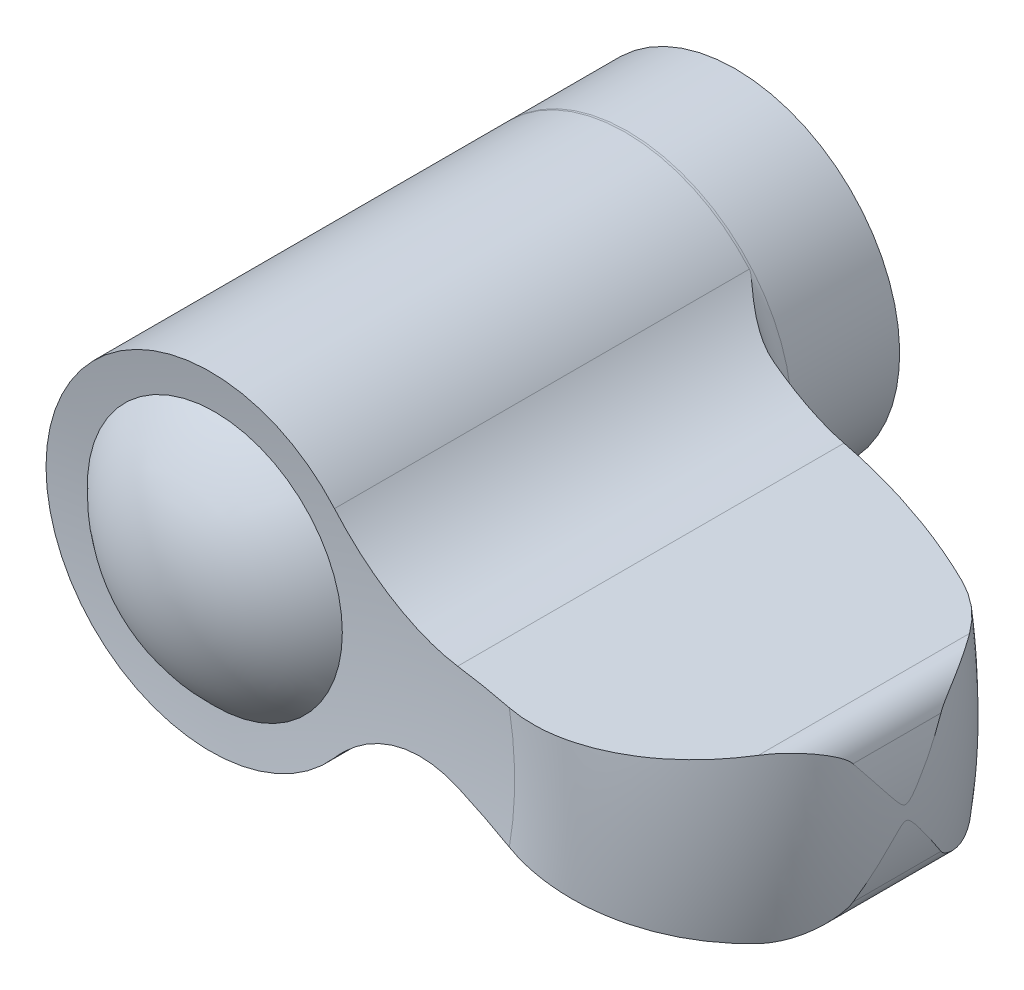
ISO-10303-21;
HEADER;
FILE_DESCRIPTION(('STEP AP214'),'2;1');
FILE_NAME('part.step','',(''),(''),'','','');
FILE_SCHEMA(('AUTOMOTIVE_DESIGN { 1 0 10303 214 1 1 1 1 }'));
ENDSEC;
DATA;
#1=APPLICATION_CONTEXT('core data for automotive mechanical design processes');
#2=APPLICATION_PROTOCOL_DEFINITION('international standard','automotive_design',2000,#1);
#3=PRODUCT_CONTEXT('',#1,'mechanical');
#4=PRODUCT('Part','Part','',(#3));
#5=PRODUCT_RELATED_PRODUCT_CATEGORY('part','',(#4));
#6=PRODUCT_DEFINITION_FORMATION('','',#4);
#7=PRODUCT_DEFINITION_CONTEXT('part definition',#1,'design');
#8=PRODUCT_DEFINITION('design','',#6,#7);
#9=PRODUCT_DEFINITION_SHAPE('','',#8);
#10=(LENGTH_UNIT() NAMED_UNIT(*) SI_UNIT(.MILLI.,.METRE.));
#11=(NAMED_UNIT(*) PLANE_ANGLE_UNIT() SI_UNIT($,.RADIAN.));
#12=(NAMED_UNIT(*) SI_UNIT($,.STERADIAN.) SOLID_ANGLE_UNIT());
#13=UNCERTAINTY_MEASURE_WITH_UNIT(LENGTH_MEASURE(1.E-05),#10,'distance_accuracy_value','');
#14=(GEOMETRIC_REPRESENTATION_CONTEXT(3) GLOBAL_UNCERTAINTY_ASSIGNED_CONTEXT((#13)) GLOBAL_UNIT_ASSIGNED_CONTEXT((#10,
#11,#12)) REPRESENTATION_CONTEXT('',''));
#15=CARTESIAN_POINT('',(0.,0.,0.));
#16=DIRECTION('',(0.,0.,1.));
#17=DIRECTION('',(1.,0.,0.));
#18=AXIS2_PLACEMENT_3D('',#15,#16,#17);
#19=CARTESIAN_POINT('',(0.,0.,53.8162032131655));
#20=DIRECTION('',(0.,0.,-1.));
#21=DIRECTION('',(0.,1.,0.));
#22=AXIS2_PLACEMENT_3D('',#19,#20,#21);
#23=DEGENERATE_TOROIDAL_SURFACE('',#22,0.00379687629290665,47.9877389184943,.F.);
#24=CARTESIAN_POINT('',(5.72647350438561,-5.62912183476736,6.5057119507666));
#25=CARTESIAN_POINT('',(5.8343902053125,-5.48849659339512,6.50203884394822));
#26=CARTESIAN_POINT('',(5.94702418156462,-5.35144406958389,6.50036273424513));
#27=CARTESIAN_POINT('',(6.18114547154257,-5.08511214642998,6.50099658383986));
#28=CARTESIAN_POINT('',(6.30263348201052,-4.95583336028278,6.50330685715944));
#29=CARTESIAN_POINT('',(6.55355658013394,-4.70600547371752,6.51189558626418));
#30=CARTESIAN_POINT('',(6.68297146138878,-4.58543575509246,6.51816430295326));
#31=CARTESIAN_POINT('',(6.9493261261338,-4.35326969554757,6.53462108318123));
#32=CARTESIAN_POINT('',(7.08626487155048,-4.24167212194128,6.54480860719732));
#33=CARTESIAN_POINT('',(7.44085197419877,-3.97172031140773,6.57542657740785));
#34=CARTESIAN_POINT('',(7.66308997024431,-3.81962161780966,6.59842633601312));
#35=CARTESIAN_POINT('',(8.12105037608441,-3.53891749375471,6.65315252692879));
#36=CARTESIAN_POINT('',(8.35677912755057,-3.41032323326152,6.68488309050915));
#37=CARTESIAN_POINT('',(8.77318529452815,-3.2095150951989,6.74688203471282));
#38=CARTESIAN_POINT('',(8.9513773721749,-3.13148322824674,6.77519644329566));
#39=CARTESIAN_POINT('',(9.31238283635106,-2.98878571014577,6.83605747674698));
#40=CARTESIAN_POINT('',(9.49519711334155,-2.92412265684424,6.86860492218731));
#41=CARTESIAN_POINT('',(9.86442053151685,-2.80838393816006,6.93774319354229));
#42=CARTESIAN_POINT('',(10.0508312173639,-2.7573142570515,6.97433579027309));
#43=CARTESIAN_POINT('',(10.4261216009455,-2.66890819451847,7.05133437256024));
#44=CARTESIAN_POINT('',(10.6150019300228,-2.6315753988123,7.09174135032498));
#45=CARTESIAN_POINT('',(11.1656271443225,-2.54319644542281,7.21430426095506));
#46=CARTESIAN_POINT('',(11.5293821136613,-2.51023156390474,7.3011979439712));
#47=CARTESIAN_POINT('',(12.2548900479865,-2.49384421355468,7.48622595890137));
#48=CARTESIAN_POINT('',(12.6166435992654,-2.51040637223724,7.58435679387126));
#49=CARTESIAN_POINT('',(13.2474750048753,-2.5819484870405,7.76579233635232));
#50=CARTESIAN_POINT('',(13.5182960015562,-2.62695119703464,7.84713854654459));
#51=CARTESIAN_POINT('',(14.0522221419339,-2.74395679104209,8.01443609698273));
#52=CARTESIAN_POINT('',(14.3153360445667,-2.8159276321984,8.10038186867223));
#53=CARTESIAN_POINT('',(14.573511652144,-2.90092614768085,8.18827734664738));
#54=B_SPLINE_CURVE_WITH_KNOTS('',3,(#24,#25,#26,#27,#28,#29,#30,#31,#32,#33,#34,#35,#36,#37,#38,
#39,#40,#41,#42,#43,#44,#45,#46,#47,#48,#49,#50,#51,#52,#53),.UNSPECIFIED.,.F.,.F.,(4,2,2,2,2,2,
2,2,2,2,2,2,2,2,4),(0.,0.531781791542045,1.06360547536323,1.59412576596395,2.12457304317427,
2.93383406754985,3.7434786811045,4.33268833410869,4.92201237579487,5.51159543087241,
6.10133227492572,7.22385334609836,8.34602603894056,9.20365240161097,10.0602629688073),.UNSPECIFIED.);
#55=CARTESIAN_POINT('',(8.59913438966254,-3.2934497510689,6.72096753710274));
#56=VERTEX_POINT('',#55);
#57=CARTESIAN_POINT('',(12.9740060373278,-2.5509345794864,7.68713900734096));
#58=VERTEX_POINT('',#57);
#59=EDGE_CURVE('E111',#56,#58,#54,.T.);
#60=ORIENTED_EDGE('',*,*,#59,.F.);
#61=CARTESIAN_POINT('',(0.,0.,6.72096753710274));
#62=DIRECTION('',(0.,0.,-1.));
#63=DIRECTION('',(0.,1.,0.));
#64=AXIS2_PLACEMENT_3D('',#61,#62,#63);
#65=CIRCLE('',#64,9.20825301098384);
#66=CARTESIAN_POINT('',(8.59913438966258,3.29344975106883,6.72096753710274));
#67=VERTEX_POINT('',#66);
#68=EDGE_CURVE('E259',#67,#56,#65,.T.);
#69=ORIENTED_EDGE('',*,*,#68,.F.);
#70=CARTESIAN_POINT('',(14.5735116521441,2.90092614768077,8.18827734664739));
#71=CARTESIAN_POINT('',(14.444548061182,2.85848650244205,8.14437726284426));
#72=CARTESIAN_POINT('',(14.3143799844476,2.81928680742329,8.1009675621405));
#73=CARTESIAN_POINT('',(14.0518730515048,2.74749123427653,8.01521118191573));
#74=CARTESIAN_POINT('',(13.9195339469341,2.71489611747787,7.97286462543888));
#75=CARTESIAN_POINT('',(13.5188922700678,2.62704823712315,7.84731673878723));
#76=CARTESIAN_POINT('',(13.2477135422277,2.58197981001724,7.76586192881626));
#77=CARTESIAN_POINT('',(12.7540704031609,2.52598840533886,7.62388178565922));
#78=CARTESIAN_POINT('',(12.5324261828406,2.5101184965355,7.56237402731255));
#79=CARTESIAN_POINT('',(12.08751652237,2.49692047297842,7.44336938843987));
#80=CARTESIAN_POINT('',(11.8642513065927,2.49958983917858,7.38587196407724));
#81=CARTESIAN_POINT('',(11.417818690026,2.52371859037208,7.27534460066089));
#82=CARTESIAN_POINT('',(11.1946513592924,2.5451625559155,7.22231103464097));
#83=CARTESIAN_POINT('',(10.7499249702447,2.60692255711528,7.12107389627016));
#84=CARTESIAN_POINT('',(10.5283654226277,2.64723258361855,7.07286879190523));
#85=CARTESIAN_POINT('',(10.0149511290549,2.7633259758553,6.96641010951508));
#86=CARTESIAN_POINT('',(9.72430670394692,2.84645759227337,6.91017010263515));
#87=CARTESIAN_POINT('',(9.15271202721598,3.04578833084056,6.80774567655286));
#88=CARTESIAN_POINT('',(8.87176138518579,3.16198611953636,6.76156085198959));
#89=CARTESIAN_POINT('',(8.42215746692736,3.37878969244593,6.69461617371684));
#90=CARTESIAN_POINT('',(8.24939239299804,3.47002205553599,6.67068056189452));
#91=CARTESIAN_POINT('',(7.9105891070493,3.66515900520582,6.62738329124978));
#92=CARTESIAN_POINT('',(7.74454968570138,3.76906130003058,6.60802080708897));
#93=CARTESIAN_POINT('',(7.4201858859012,3.98904331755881,6.57399550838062));
#94=CARTESIAN_POINT('',(7.26186321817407,4.10512572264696,6.55933373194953));
#95=CARTESIAN_POINT('',(6.95400232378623,4.34877983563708,6.5348172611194));
#96=CARTESIAN_POINT('',(6.80446169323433,4.47634837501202,6.52496124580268));
#97=CARTESIAN_POINT('',(6.48985811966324,4.76544752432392,6.508830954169));
#98=CARTESIAN_POINT('',(6.32662184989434,4.92902525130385,6.50347831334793));
#99=CARTESIAN_POINT('',(6.01509165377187,5.26944006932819,6.49953233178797));
#100=CARTESIAN_POINT('',(5.86677467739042,5.4462559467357,6.50092839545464));
#101=CARTESIAN_POINT('',(5.72647350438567,5.6291218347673,6.5057119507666));
#102=B_SPLINE_CURVE_WITH_KNOTS('',3,(#70,#71,#72,#73,#74,#75,#76,#77,#78,#79,#80,#81,#82,#83,
#84,#85,#86,#87,#88,#89,#90,#91,#92,#93,#94,#95,#96,#97,#98,#99,#100,#101),.UNSPECIFIED.,.F.,
.F.,(4,2,2,2,2,2,2,2,2,2,2,2,2,2,2,4),(0.,0.427968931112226,0.855987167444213,1.71449697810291,
2.40547838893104,3.09636591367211,3.78668654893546,4.47678745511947,5.39713866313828,
6.31745276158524,6.9074383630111,7.49731740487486,8.08732662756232,8.67717358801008,
9.36965494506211,10.0610494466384),.UNSPECIFIED.);
#103=CARTESIAN_POINT('',(12.9740060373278,2.55093457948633,7.68713900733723));
#104=VERTEX_POINT('',#103);
#105=EDGE_CURVE('E34',#104,#67,#102,.T.);
#106=ORIENTED_EDGE('',*,*,#105,.F.);
#107=CARTESIAN_POINT('',(22.7937803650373,3.66435560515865,11.748830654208));
#108=CARTESIAN_POINT('',(22.0151817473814,3.57607373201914,11.3191647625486));
#109=CARTESIAN_POINT('',(21.2246327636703,3.48643685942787,10.9114400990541));
#110=CARTESIAN_POINT('',(19.6246380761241,3.30502049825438,10.1422358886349));
#111=CARTESIAN_POINT('',(18.8152586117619,3.21324852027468,9.78061678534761));
#112=CARTESIAN_POINT('',(17.1777441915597,3.02757796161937,9.10330614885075));
#113=CARTESIAN_POINT('',(16.3496092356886,2.93367938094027,8.78761461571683));
#114=CARTESIAN_POINT('',(14.6745631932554,2.74375327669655,8.20219267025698));
#115=CARTESIAN_POINT('',(13.8276016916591,2.64772003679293,7.93260835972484));
#116=CARTESIAN_POINT('',(12.9738060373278,2.55091190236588,7.68708148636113));
#117=B_SPLINE_CURVE_WITH_KNOTS('',3,(#107,#108,#109,#110,#111,#112,#113,#114,#115,#116),
.UNSPECIFIED.,.F.,.F.,(4,2,2,2,4),(0.,2.68061595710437,5.3529149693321,8.02521398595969,
10.7058299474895),.UNSPECIFIED.);
#118=CARTESIAN_POINT('',(22.7934179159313,3.66431450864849,11.748630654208));
#119=VERTEX_POINT('',#118);
#120=EDGE_CURVE('E118',#119,#104,#117,.T.);
#121=ORIENTED_EDGE('',*,*,#120,.F.);
#122=CARTESIAN_POINT('',(0.,0.,11.748630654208));
#123=DIRECTION('',(0.,0.,-1.));
#124=DIRECTION('',(0.,1.,0.));
#125=AXIS2_PLACEMENT_3D('',#122,#123,#124);
#126=CIRCLE('',#125,23.0860802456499);
#127=CARTESIAN_POINT('',(22.7934179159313,-3.66431450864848,11.748630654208));
#128=VERTEX_POINT('',#127);
#129=EDGE_CURVE('E272',#119,#128,#126,.T.);
#130=ORIENTED_EDGE('',*,*,#129,.T.);
#131=CARTESIAN_POINT('',(12.9738060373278,-2.55091190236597,7.68708148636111));
#132=CARTESIAN_POINT('',(13.827601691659,-2.647720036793,7.93260835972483));
#133=CARTESIAN_POINT('',(14.6745631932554,-2.74375327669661,8.20219267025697));
#134=CARTESIAN_POINT('',(16.3496092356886,-2.93367938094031,8.78761461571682));
#135=CARTESIAN_POINT('',(17.1777441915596,-3.02757796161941,9.10330614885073));
#136=CARTESIAN_POINT('',(18.8152586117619,-3.2132485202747,9.7806167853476));
#137=CARTESIAN_POINT('',(19.624638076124,-3.3050204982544,10.1422358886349));
#138=CARTESIAN_POINT('',(21.2246327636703,-3.48643685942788,10.9114400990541));
#139=CARTESIAN_POINT('',(22.0151817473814,-3.57607373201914,11.3191647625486));
#140=CARTESIAN_POINT('',(22.7937803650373,-3.66435560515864,11.748830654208));
#141=B_SPLINE_CURVE_WITH_KNOTS('',3,(#131,#132,#133,#134,#135,#136,#137,#138,#139,#140),
.UNSPECIFIED.,.F.,.F.,(4,2,2,2,4),(0.,2.68061596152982,5.35291497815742,8.02521399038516,
10.7058299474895),.UNSPECIFIED.);
#142=EDGE_CURVE('E253',#58,#128,#141,.T.);
#143=ORIENTED_EDGE('',*,*,#142,.F.);
#144=EDGE_LOOP('',(#60,#69,#106,#121,#130,#143));
#145=FACE_BOUND('',#144,.T.);
#146=ADVANCED_FACE('F14',(#145),#23,.F.);
#147=CARTESIAN_POINT('',(0.,0.,19.2));
#148=DIRECTION('',(0.,0.,-1.));
#149=DIRECTION('',(0.,1.,0.));
#150=AXIS2_PLACEMENT_3D('',#147,#148,#149);
#151=TOROIDAL_SURFACE('',#150,18.9962031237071,8.5);
#152=CARTESIAN_POINT('',(22.7930554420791,-3.66427340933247,11.748430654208));
#153=CARTESIAN_POINT('',(23.0031467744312,-3.68809474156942,11.8643128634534));
#154=CARTESIAN_POINT('',(23.2083192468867,-3.71135834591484,11.9892297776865));
#155=CARTESIAN_POINT('',(23.607508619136,-3.75662067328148,12.2562034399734));
#156=CARTESIAN_POINT('',(23.8015192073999,-3.77861868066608,12.3982697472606));
#157=CARTESIAN_POINT('',(24.1735734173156,-3.82080427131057,12.6958768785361));
#158=CARTESIAN_POINT('',(24.351835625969,-3.84101663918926,12.8511412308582));
#159=CARTESIAN_POINT('',(24.6947539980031,-3.87989864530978,13.1760299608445));
#160=CARTESIAN_POINT('',(24.8594191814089,-3.89856930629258,13.3456446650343));
#161=CARTESIAN_POINT('',(25.0945313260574,-3.92522763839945,13.6089870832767));
#162=CARTESIAN_POINT('',(25.1705376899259,-3.93384566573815,13.6977459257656));
#163=CARTESIAN_POINT('',(25.3191641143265,-3.95069776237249,13.8787426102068));
#164=CARTESIAN_POINT('',(25.3917679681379,-3.95892999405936,13.9709939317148));
#165=CARTESIAN_POINT('',(25.4624460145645,-3.96694386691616,14.0647337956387));
#166=B_SPLINE_CURVE_WITH_KNOTS('',3,(#152,#153,#154,#155,#156,#157,#158,#159,#160,#161,#162,
#163,#164,#165),.UNSPECIFIED.,.F.,.F.,(4,2,2,2,2,2,4),(0.,0.72312081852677,1.44664658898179,
2.1576221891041,2.86812228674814,3.21955336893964,3.57251648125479),.UNSPECIFIED.);
#167=CARTESIAN_POINT('',(25.4622460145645,-3.96692118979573,14.0644685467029));
#168=VERTEX_POINT('',#167);
#169=EDGE_CURVE('E202',#128,#168,#166,.T.);
#170=ORIENTED_EDGE('',*,*,#169,.F.);
#171=ORIENTED_EDGE('',*,*,#129,.F.);
#172=CARTESIAN_POINT('',(25.4624460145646,3.9669438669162,14.0647337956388));
#173=CARTESIAN_POINT('',(25.3176482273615,3.95052588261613,13.8726423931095));
#174=CARTESIAN_POINT('',(25.1646852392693,3.93318208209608,13.6867848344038));
#175=CARTESIAN_POINT('',(24.843546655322,3.89676959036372,13.328708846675));
#176=CARTESIAN_POINT('',(24.6753627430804,3.87769995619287,13.1564979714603));
#177=CARTESIAN_POINT('',(24.3280983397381,3.83832517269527,12.8299559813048));
#178=CARTESIAN_POINT('',(24.1492572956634,3.81804717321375,12.6753666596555));
#179=CARTESIAN_POINT('',(23.7794678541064,3.77611837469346,12.3818419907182));
#180=CARTESIAN_POINT('',(23.5885275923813,3.75446849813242,12.2428962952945));
#181=CARTESIAN_POINT('',(23.29510594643,3.72119870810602,12.0476136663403));
#182=CARTESIAN_POINT('',(23.1966868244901,3.71003939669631,11.9850157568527));
#183=CARTESIAN_POINT('',(22.996930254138,3.68738987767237,11.8636988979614));
#184=CARTESIAN_POINT('',(22.8955819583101,3.6758984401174,11.8049980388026));
#185=CARTESIAN_POINT('',(22.7930554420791,3.66427340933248,11.748430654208));
#186=B_SPLINE_CURVE_WITH_KNOTS('',3,(#172,#173,#174,#175,#176,#177,#178,#179,#180,#181,#182,
#183,#184,#185),.UNSPECIFIED.,.F.,.F.,(4,2,2,2,2,2,4),(0.,0.723122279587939,1.44664207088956,
2.15761898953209,2.86812280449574,3.21955383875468,3.57251616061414),.UNSPECIFIED.);
#187=CARTESIAN_POINT('',(25.4622460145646,3.96692118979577,14.064468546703));
#188=VERTEX_POINT('',#187);
#189=EDGE_CURVE('E176',#188,#119,#186,.T.);
#190=ORIENTED_EDGE('',*,*,#189,.F.);
#191=CARTESIAN_POINT('',(27.0662274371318,2.91329579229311,17.0606084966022));
#192=CARTESIAN_POINT('',(27.0599044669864,2.93404348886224,17.0449693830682));
#193=CARTESIAN_POINT('',(27.0533539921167,2.95397186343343,17.028409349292));
#194=CARTESIAN_POINT('',(27.0398780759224,2.99237944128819,16.9938956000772));
#195=CARTESIAN_POINT('',(27.0329534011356,3.01086143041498,16.975944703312));
#196=CARTESIAN_POINT('',(27.0117821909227,3.06432733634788,16.9207935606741));
#197=CARTESIAN_POINT('',(26.9970625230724,3.09756971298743,16.8821011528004));
#198=CARTESIAN_POINT('',(26.9667104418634,3.16037631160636,16.8027280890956));
#199=CARTESIAN_POINT('',(26.9510851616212,3.18996471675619,16.7620632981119));
#200=CARTESIAN_POINT('',(26.9188808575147,3.24656598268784,16.6792223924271));
#201=CARTESIAN_POINT('',(26.9022999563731,3.27357347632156,16.6370433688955));
#202=CARTESIAN_POINT('',(26.8637068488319,3.33237832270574,16.5403415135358));
#203=CARTESIAN_POINT('',(26.8414274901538,3.36352650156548,16.4855326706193));
#204=CARTESIAN_POINT('',(26.7954902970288,3.42300845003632,16.3749669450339));
#205=CARTESIAN_POINT('',(26.7718320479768,3.45134136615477,16.3192097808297));
#206=CARTESIAN_POINT('',(26.6988184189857,3.53269576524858,16.1510597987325));
#207=CARTESIAN_POINT('',(26.6474203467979,3.58207853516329,16.0377788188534));
#208=CARTESIAN_POINT('',(26.5386152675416,3.67302548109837,15.8090789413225));
#209=CARTESIAN_POINT('',(26.4811420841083,3.71448593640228,15.69365089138));
#210=CARTESIAN_POINT('',(26.3608005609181,3.78900736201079,15.4629209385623));
#211=CARTESIAN_POINT('',(26.2979336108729,3.82207048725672,15.347619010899));
#212=CARTESIAN_POINT('',(26.175018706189,3.87583923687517,15.1319806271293));
#213=CARTESIAN_POINT('',(26.1155788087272,3.89756584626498,15.0315517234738));
#214=CARTESIAN_POINT('',(25.9928445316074,3.93363778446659,14.8317693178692));
#215=CARTESIAN_POINT('',(25.9295516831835,3.94798602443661,14.7324154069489));
#216=CARTESIAN_POINT('',(25.8006081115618,3.96827931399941,14.5371127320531));
#217=CARTESIAN_POINT('',(25.7350268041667,3.97438174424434,14.4411352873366));
#218=CARTESIAN_POINT('',(25.6343333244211,3.97684432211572,14.2986257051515));
#219=CARTESIAN_POINT('',(25.6003578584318,3.97654750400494,14.2513334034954));
#220=CARTESIAN_POINT('',(25.5317073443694,3.97355919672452,14.1573191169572));
#221=CARTESIAN_POINT('',(25.4970321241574,3.97086711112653,14.1105972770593));
#222=CARTESIAN_POINT('',(25.4620460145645,3.96689849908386,14.0642033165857));
#223=B_SPLINE_CURVE_WITH_KNOTS('',3,(#191,#192,#193,#194,#195,#196,#197,#198,#199,#200,#201,
#202,#203,#204,#205,#206,#207,#208,#209,#210,#211,#212,#213,#214,#215,#216,#217,#218,#219,#220,
#221,#222),.UNSPECIFIED.,.F.,.F.,(4,2,2,2,2,2,2,2,2,2,2,2,2,2,2,4),(0.,0.0801269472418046,
0.160095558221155,0.319090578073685,0.476969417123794,0.635169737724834,0.835654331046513,
1.03619952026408,1.43725454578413,1.84324613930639,2.24913344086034,2.60497867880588,
2.96068340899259,3.3094983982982,3.4841451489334,3.65883539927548),.UNSPECIFIED.);
#224=CARTESIAN_POINT('',(27.0661665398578,2.91349579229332,17.0604579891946));
#225=VERTEX_POINT('',#224);
#226=EDGE_CURVE('E222',#225,#188,#223,.T.);
#227=ORIENTED_EDGE('',*,*,#226,.F.);
#228=CARTESIAN_POINT('',(27.0661056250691,2.91369579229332,21.3396925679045));
#229=CARTESIAN_POINT('',(27.1358381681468,2.68489957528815,21.1671598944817));
#230=CARTESIAN_POINT('',(27.1971439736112,2.45401889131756,20.993988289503));
#231=CARTESIAN_POINT('',(27.302737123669,1.99060015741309,20.6459141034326));
#232=CARTESIAN_POINT('',(27.3470659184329,1.75806757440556,20.4710168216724));
#233=CARTESIAN_POINT('',(27.4072885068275,1.36784223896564,20.1751595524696));
#234=CARTESIAN_POINT('',(27.4277420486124,1.21022782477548,20.0550181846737));
#235=CARTESIAN_POINT('',(27.4500737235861,0.999511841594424,19.8905653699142));
#236=CARTESIAN_POINT('',(27.4553573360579,0.945405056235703,19.8479931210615));
#237=CARTESIAN_POINT('',(27.4649819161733,0.837873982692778,19.7620964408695));
#238=CARTESIAN_POINT('',(27.4693247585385,0.784448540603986,19.718773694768));
#239=CARTESIAN_POINT('',(27.4756096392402,0.698786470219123,19.6472168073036));
#240=CARTESIAN_POINT('',(27.4778390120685,0.66616641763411,19.6194622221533));
#241=CARTESIAN_POINT('',(27.4819415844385,0.601571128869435,19.5627733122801));
#242=CARTESIAN_POINT('',(27.4838127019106,0.569600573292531,19.5338332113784));
#243=CARTESIAN_POINT('',(27.4871857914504,0.507069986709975,19.4738567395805));
#244=CARTESIAN_POINT('',(27.488683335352,0.476530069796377,19.4428003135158));
#245=CARTESIAN_POINT('',(27.4912374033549,0.419443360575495,19.3770542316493));
#246=CARTESIAN_POINT('',(27.4922982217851,0.392859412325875,19.3424043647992));
#247=CARTESIAN_POINT('',(27.49330335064,0.36599071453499,19.2899559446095));
#248=CARTESIAN_POINT('',(27.4935286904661,0.359731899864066,19.2754525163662));
#249=CARTESIAN_POINT('',(27.4938627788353,0.350326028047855,19.2455223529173));
#250=CARTESIAN_POINT('',(27.4939724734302,0.347153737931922,19.2301042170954));
#251=CARTESIAN_POINT('',(27.494045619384,0.345040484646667,19.2029197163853));
#252=CARTESIAN_POINT('',(27.4940391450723,0.345229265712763,19.1912207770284));
#253=CARTESIAN_POINT('',(27.4939519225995,0.347744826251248,19.1680349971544));
#254=CARTESIAN_POINT('',(27.4938709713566,0.350077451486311,19.156548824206));
#255=CARTESIAN_POINT('',(27.4936016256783,0.357693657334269,19.1298831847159));
#256=CARTESIAN_POINT('',(27.4933843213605,0.363755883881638,19.1149342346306));
#257=CARTESIAN_POINT('',(27.4928541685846,0.378046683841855,19.0861089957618));
#258=CARTESIAN_POINT('',(27.4925409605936,0.386283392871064,19.0722369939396));
#259=CARTESIAN_POINT('',(27.4910295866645,0.424441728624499,19.0141899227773));
#260=CARTESIAN_POINT('',(27.4894615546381,0.460414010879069,18.9742220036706));
#261=CARTESIAN_POINT('',(27.4857154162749,0.535731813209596,18.8976667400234));
#262=CARTESIAN_POINT('',(27.4835324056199,0.575102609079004,18.8611098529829));
#263=CARTESIAN_POINT('',(27.4761857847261,0.694178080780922,18.7549959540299));
#264=CARTESIAN_POINT('',(27.4701835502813,0.776003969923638,18.6877817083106));
#265=CARTESIAN_POINT('',(27.4559776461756,0.94099930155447,18.5552632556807));
#266=CARTESIAN_POINT('',(27.44777137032,1.02417022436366,18.4899614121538));
#267=CARTESIAN_POINT('',(27.4292161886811,1.19063588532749,18.3607656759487));
#268=CARTESIAN_POINT('',(27.4188797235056,1.27392723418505,18.2968658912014));
#269=CARTESIAN_POINT('',(27.3960464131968,1.44060811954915,18.1696743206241));
#270=CARTESIAN_POINT('',(27.3835505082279,1.52399759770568,18.1063822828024));
#271=CARTESIAN_POINT('',(27.3521730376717,1.71666645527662,17.9605757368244));
#272=CARTESIAN_POINT('',(27.3325142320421,1.82593050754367,17.8782059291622));
#273=CARTESIAN_POINT('',(27.2894799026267,2.04412713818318,17.713959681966));
#274=CARTESIAN_POINT('',(27.2661036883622,2.15305965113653,17.6320833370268));
#275=CARTESIAN_POINT('',(27.2154930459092,2.3710302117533,17.4682960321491));
#276=CARTESIAN_POINT('',(27.188236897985,2.48006516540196,17.3863876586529));
#277=CARTESIAN_POINT('',(27.1299794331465,2.69743594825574,17.2230188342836));
#278=CARTESIAN_POINT('',(27.0989787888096,2.80577189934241,17.1415583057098));
#279=CARTESIAN_POINT('',(27.0661056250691,2.91369579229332,17.0603074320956));
#280=B_SPLINE_CURVE_WITH_KNOTS('',3,(#228,#229,#230,#231,#232,#233,#234,#235,#236,#237,#238,
#239,#240,#241,#242,#243,#244,#245,#246,#247,#248,#249,#250,#251,#252,#253,#254,#255,#256,#257,
#258,#259,#260,#261,#262,#263,#264,#265,#266,#267,#268,#269,#270,#271,#272,#273,#274,#275,#276,
#277,#278,#279),.UNSPECIFIED.,.F.,.F.,(4,2,2,2,2,2,2,2,2,2,2,2,2,2,2,2,2,2,2,2,2,2,2,2,2,4),(0.,
0.884636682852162,1.76709950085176,2.36462389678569,2.57176761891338,2.77849467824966,
2.90716183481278,3.03655546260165,3.16741686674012,3.29695886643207,3.34412725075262,
3.39090670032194,3.42580127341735,3.46079127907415,3.50890437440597,3.5572000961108,
3.71732257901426,3.87876002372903,4.19660644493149,4.51483037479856,4.83124597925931,
5.14752417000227,5.56218402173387,5.97692098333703,6.39407827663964,6.81116075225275),.UNSPECIFIED.);
#281=CARTESIAN_POINT('',(27.0661665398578,2.91349579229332,21.3395420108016));
#282=VERTEX_POINT('',#281);
#283=EDGE_CURVE('E215',#282,#225,#280,.T.);
#284=ORIENTED_EDGE('',*,*,#283,.F.);
#285=CARTESIAN_POINT('',(25.4620460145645,3.96689849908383,24.3357966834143));
#286=CARTESIAN_POINT('',(25.4973279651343,3.97090059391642,24.2890104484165));
#287=CARTESIAN_POINT('',(25.5322936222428,3.97360457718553,24.2418908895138));
#288=CARTESIAN_POINT('',(25.6015117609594,3.9765773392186,24.1470731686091));
#289=CARTESIAN_POINT('',(25.6357644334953,3.97684677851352,24.0993751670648));
#290=CARTESIAN_POINT('',(25.7372643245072,3.97424927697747,23.9556435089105));
#291=CARTESIAN_POINT('',(25.803354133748,3.9679869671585,23.8588387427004));
#292=CARTESIAN_POINT('',(25.9330819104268,3.94728095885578,23.6621191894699));
#293=CARTESIAN_POINT('',(25.9966591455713,3.93270006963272,23.5621795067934));
#294=CARTESIAN_POINT('',(26.1199164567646,3.89609500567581,23.3612186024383));
#295=CARTESIAN_POINT('',(26.1795948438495,3.87406763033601,23.2601969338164));
#296=CARTESIAN_POINT('',(26.2991498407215,3.82127019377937,23.0500077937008));
#297=CARTESIAN_POINT('',(26.3587105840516,3.78997143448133,22.9407936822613));
#298=CARTESIAN_POINT('',(26.4729841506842,3.71983959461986,22.7222577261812));
#299=CARTESIAN_POINT('',(26.527696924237,3.68100643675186,22.6129358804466));
#300=CARTESIAN_POINT('',(26.6316725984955,3.59611845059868,22.3960324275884));
#301=CARTESIAN_POINT('',(26.6809861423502,3.55014270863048,22.2884445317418));
#302=CARTESIAN_POINT('',(26.7512981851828,3.4747933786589,22.1284572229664));
#303=CARTESIAN_POINT('',(26.7741303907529,3.44860625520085,22.0753491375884));
#304=CARTESIAN_POINT('',(26.8185614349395,3.39381466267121,21.9698675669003));
#305=CARTESIAN_POINT('',(26.8401604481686,3.36521053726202,21.9174939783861));
#306=CARTESIAN_POINT('',(26.8805846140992,3.30731227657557,21.8176313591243));
#307=CARTESIAN_POINT('',(26.8994974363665,3.27821722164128,21.7700627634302));
#308=CARTESIAN_POINT('',(26.9361598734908,3.21705326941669,21.6765400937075));
#309=CARTESIAN_POINT('',(26.9539119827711,3.18499113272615,21.6305826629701));
#310=CARTESIAN_POINT('',(26.979683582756,3.13379224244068,21.5633710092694));
#311=CARTESIAN_POINT('',(26.9881633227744,3.11613188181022,21.5411697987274));
#312=CARTESIAN_POINT('',(27.0047772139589,3.07963126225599,21.497647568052));
#313=CARTESIAN_POINT('',(27.0129116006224,3.06079182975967,21.4763259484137));
#314=CARTESIAN_POINT('',(27.0288524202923,3.02157463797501,21.4347066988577));
#315=CARTESIAN_POINT('',(27.0366563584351,3.00118761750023,21.4144166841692));
#316=CARTESIAN_POINT('',(27.0518104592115,2.95863957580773,21.3755019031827));
#317=CARTESIAN_POINT('',(27.0591594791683,2.93647438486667,21.3568812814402));
#318=CARTESIAN_POINT('',(27.0662274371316,2.91329579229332,21.339391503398));
#319=B_SPLINE_CURVE_WITH_KNOTS('',3,(#285,#286,#287,#288,#289,#290,#291,#292,#293,#294,#295,
#296,#297,#298,#299,#300,#301,#302,#303,#304,#305,#306,#307,#308,#309,#310,#311,#312,#313,#314,
#315,#316,#317,#318),.UNSPECIFIED.,.F.,.F.,(4,2,2,2,2,2,2,2,2,2,2,2,2,2,2,2,4),(0.,
0.176166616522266,0.352285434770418,0.70402218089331,1.06173478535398,1.41960133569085,
1.80410440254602,2.18861141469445,2.56913005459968,2.75947223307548,2.94978739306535,
3.12635576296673,3.30253128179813,3.39132762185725,3.4800624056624,3.56937794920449,
3.65890942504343),.UNSPECIFIED.);
#320=CARTESIAN_POINT('',(25.4622460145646,3.96692118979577,24.3355314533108));
#321=VERTEX_POINT('',#320);
#322=EDGE_CURVE('E130',#321,#282,#319,.T.);
#323=ORIENTED_EDGE('',*,*,#322,.F.);
#324=CARTESIAN_POINT('',(12.9738060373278,2.55091190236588,25.4378670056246));
#325=CARTESIAN_POINT('',(13.1491351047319,2.57079169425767,25.6006932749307));
#326=CARTESIAN_POINT('',(13.3313237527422,2.59144926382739,25.7560302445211));
#327=CARTESIAN_POINT('',(13.7080406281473,2.63416353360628,26.0507076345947));
#328=CARTESIAN_POINT('',(13.9025682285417,2.65622016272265,26.1900488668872));
#329=CARTESIAN_POINT('',(14.3024474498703,2.70156070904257,26.451632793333));
#330=CARTESIAN_POINT('',(14.50779061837,2.72484366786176,26.5738885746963));
#331=CARTESIAN_POINT('',(14.9279718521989,2.77248617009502,26.8005676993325));
#332=CARTESIAN_POINT('',(15.1428098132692,2.79684570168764,26.9049912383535));
#333=CARTESIAN_POINT('',(15.5805599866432,2.84648026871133,27.0953078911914));
#334=CARTESIAN_POINT('',(15.8034758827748,2.87175572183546,27.1811924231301));
#335=CARTESIAN_POINT('',(16.2557077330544,2.92303230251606,27.3337583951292));
#336=CARTESIAN_POINT('',(16.4850237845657,2.94903344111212,27.4004395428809));
#337=CARTESIAN_POINT('',(16.9483922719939,3.00157275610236,27.5141106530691));
#338=CARTESIAN_POINT('',(17.1824440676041,3.02811085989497,27.5611032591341));
#339=CARTESIAN_POINT('',(17.6536491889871,3.08153873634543,27.6350700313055));
#340=CARTESIAN_POINT('',(17.8908024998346,3.10842850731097,27.6620442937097));
#341=CARTESIAN_POINT('',(18.3664573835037,3.16236092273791,27.6957712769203));
#342=CARTESIAN_POINT('',(18.6049585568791,3.18940352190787,27.7025297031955));
#343=CARTESIAN_POINT('',(19.0817621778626,3.24346618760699,27.6957846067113));
#344=CARTESIAN_POINT('',(19.320064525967,3.27048624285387,27.6822739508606));
#345=CARTESIAN_POINT('',(19.7945979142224,3.32429149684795,27.6350753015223));
#346=CARTESIAN_POINT('',(20.0308296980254,3.35107677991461,27.6013948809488));
#347=CARTESIAN_POINT('',(20.4997342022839,3.40424379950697,27.5140757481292));
#348=CARTESIAN_POINT('',(20.7324052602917,3.43062534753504,27.4604279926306));
#349=CARTESIAN_POINT('',(21.1921149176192,3.48274980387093,27.3336347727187));
#350=CARTESIAN_POINT('',(21.4191604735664,3.50849350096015,27.2605148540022));
#351=CARTESIAN_POINT('',(21.8662116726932,3.55918267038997,27.0952974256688));
#352=CARTESIAN_POINT('',(22.0862204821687,3.58412850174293,27.0032085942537));
#353=CARTESIAN_POINT('',(22.5178258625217,3.63306633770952,26.8006413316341));
#354=CARTESIAN_POINT('',(22.7294188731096,3.65705793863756,26.6901552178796));
#355=CARTESIAN_POINT('',(23.1425039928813,3.70389584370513,26.4516476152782));
#356=CARTESIAN_POINT('',(23.3440001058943,3.72674260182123,26.3236331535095));
#357=CARTESIAN_POINT('',(23.7228814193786,3.76970228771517,26.0597623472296));
#358=CARTESIAN_POINT('',(23.9009833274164,3.78989647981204,25.9249465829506));
#359=CARTESIAN_POINT('',(24.246047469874,3.82902178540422,25.641585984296));
#360=CARTESIAN_POINT('',(24.4130102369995,3.84795295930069,25.493041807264));
#361=CARTESIAN_POINT('',(24.7347950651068,3.88443872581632,25.1830996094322));
#362=CARTESIAN_POINT('',(24.8896137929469,3.90199294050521,25.0216980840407));
#363=CARTESIAN_POINT('',(25.1861210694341,3.9356125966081,24.687083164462));
#364=CARTESIAN_POINT('',(25.3278083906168,3.95167789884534,24.5138686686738));
#365=CARTESIAN_POINT('',(25.4624460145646,3.9669438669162,24.3352662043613));
#366=B_SPLINE_CURVE_WITH_KNOTS('',3,(#324,#325,#326,#327,#328,#329,#330,#331,#332,#333,#334,
#335,#336,#337,#338,#339,#340,#341,#342,#343,#344,#345,#346,#347,#348,#349,#350,#351,#352,#353,
#354,#355,#356,#357,#358,#359,#360,#361,#362,#363,#364,#365),.UNSPECIFIED.,.F.,.F.,(4,2,2,2,2,2,
2,2,2,2,2,2,2,2,2,2,2,2,2,2,4),(0.,0.720078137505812,1.44011971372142,2.15960668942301,
2.87908576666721,3.59889718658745,4.31871956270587,5.03844525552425,5.75816748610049,
6.47768657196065,7.197458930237,7.91696121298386,8.63678975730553,9.3556785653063,
10.0742392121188,10.7931006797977,11.5116747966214,12.183835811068,12.8559646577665,
13.5282773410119,14.2006528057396),.UNSPECIFIED.);
#367=CARTESIAN_POINT('',(16.3669769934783,2.93564863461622,27.3634802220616));
#368=VERTEX_POINT('',#367);
#369=EDGE_CURVE('E169',#368,#321,#366,.T.);
#370=ORIENTED_EDGE('',*,*,#369,.F.);
#371=CARTESIAN_POINT('',(0.,0.,27.3634802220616));
#372=DIRECTION('',(0.,0.,-1.));
#373=DIRECTION('',(0.,1.,0.));
#374=AXIS2_PLACEMENT_3D('',#371,#372,#373);
#375=CIRCLE('',#374,16.6281679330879);
#376=CARTESIAN_POINT('',(16.3669769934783,-2.93564863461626,27.3634802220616));
#377=VERTEX_POINT('',#376);
#378=EDGE_CURVE('E126',#368,#377,#375,.T.);
#379=ORIENTED_EDGE('',*,*,#378,.T.);
#380=CARTESIAN_POINT('',(25.4624460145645,-3.96694386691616,24.3352662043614));
#381=CARTESIAN_POINT('',(25.3187753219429,-3.95065367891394,24.5258592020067));
#382=CARTESIAN_POINT('',(25.1670718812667,-3.93345269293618,24.7103126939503));
#383=CARTESIAN_POINT('',(24.8487753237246,-3.89736244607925,25.0656962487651));
#384=CARTESIAN_POINT('',(24.6821829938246,-3.87847327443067,25.2366270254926));
#385=CARTESIAN_POINT('',(24.3354146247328,-3.83915473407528,25.5636038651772));
#386=CARTESIAN_POINT('',(24.155250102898,-3.81872667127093,25.7196622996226));
#387=CARTESIAN_POINT('',(23.7825061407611,-3.77646287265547,26.0159552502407));
#388=CARTESIAN_POINT('',(23.5899268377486,-3.75462715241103,26.1561899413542));
#389=CARTESIAN_POINT('',(23.1936317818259,-3.70969299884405,26.4199034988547));
#390=CARTESIAN_POINT('',(22.9899110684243,-3.68659400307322,26.5433748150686));
#391=CARTESIAN_POINT('',(22.5728596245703,-3.63930637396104,26.7726173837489));
#392=CARTESIAN_POINT('',(22.3595287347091,-3.61511772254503,26.8783883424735));
#393=CARTESIAN_POINT('',(21.9248037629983,-3.56582616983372,27.0714705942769));
#394=CARTESIAN_POINT('',(21.7034106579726,-3.54072337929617,27.1587841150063));
#395=CARTESIAN_POINT('',(21.2541109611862,-3.48977926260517,27.3143541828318));
#396=CARTESIAN_POINT('',(21.0262043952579,-3.46393793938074,27.382610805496));
#397=CARTESIAN_POINT('',(20.5653386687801,-3.41168240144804,27.499630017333));
#398=CARTESIAN_POINT('',(20.3323761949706,-3.38526781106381,27.5483793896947));
#399=CARTESIAN_POINT('',(19.8631195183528,-3.33206086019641,27.625993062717));
#400=CARTESIAN_POINT('',(19.6268241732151,-3.30526837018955,27.6548503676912));
#401=CARTESIAN_POINT('',(19.1527466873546,-3.25151480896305,27.6924480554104));
#402=CARTESIAN_POINT('',(18.9149651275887,-3.22455380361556,27.7011958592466));
#403=CARTESIAN_POINT('',(18.4394054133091,-3.17063217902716,27.6985411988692));
#404=CARTESIAN_POINT('',(18.20162730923,-3.1436715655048,27.6871295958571));
#405=CARTESIAN_POINT('',(17.727541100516,-3.0899170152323,27.6441968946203));
#406=CARTESIAN_POINT('',(17.4912354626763,-3.06312335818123,27.6126482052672));
#407=CARTESIAN_POINT('',(17.0222072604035,-3.00994231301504,27.5296647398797));
#408=CARTESIAN_POINT('',(16.7894831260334,-2.98355474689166,27.4782389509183));
#409=CARTESIAN_POINT('',(16.3290547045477,-2.93134879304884,27.3558435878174));
#410=CARTESIAN_POINT('',(16.1013527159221,-2.90553066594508,27.2848652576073));
#411=CARTESIAN_POINT('',(15.6527743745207,-2.85466834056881,27.1239117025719));
#412=CARTESIAN_POINT('',(15.431895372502,-2.82962384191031,27.0339439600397));
#413=CARTESIAN_POINT('',(15.0102613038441,-2.78181660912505,26.8410469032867));
#414=CARTESIAN_POINT('',(14.8090655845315,-2.75900391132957,26.7390914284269));
#415=CARTESIAN_POINT('',(14.4153696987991,-2.71436446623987,26.5194081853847));
#416=CARTESIAN_POINT('',(14.2228691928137,-2.69253768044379,26.4016810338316));
#417=CARTESIAN_POINT('',(13.8477288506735,-2.65000216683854,26.1511548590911));
#418=CARTESIAN_POINT('',(13.6650918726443,-2.62929376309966,26.01835150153));
#419=CARTESIAN_POINT('',(13.3108689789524,-2.58912998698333,25.7385443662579));
#420=CARTESIAN_POINT('',(13.1392840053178,-2.5696747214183,25.5915393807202));
#421=CARTESIAN_POINT('',(12.9738060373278,-2.55091190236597,25.4378670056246));
#422=B_SPLINE_CURVE_WITH_KNOTS('',3,(#380,#381,#382,#383,#384,#385,#386,#387,#388,#389,#390,
#391,#392,#393,#394,#395,#396,#397,#398,#399,#400,#401,#402,#403,#404,#405,#406,#407,#408,#409,
#410,#411,#412,#413,#414,#415,#416,#417,#418,#419,#420,#421),.UNSPECIFIED.,.F.,.F.,(4,2,2,2,2,2,
2,2,2,2,2,2,2,2,2,2,2,2,2,2,4),(0.,0.717478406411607,1.4349189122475,2.15175731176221,
2.86858778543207,3.58574005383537,4.30290422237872,5.0199817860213,5.73705650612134,
6.45461624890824,7.17242821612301,7.8899752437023,8.60784763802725,9.32670575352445,
10.0452392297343,10.7640950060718,11.4826680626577,12.1620723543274,12.8414500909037,
13.5210236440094,14.2006550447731),.UNSPECIFIED.);
#423=CARTESIAN_POINT('',(25.4622460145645,-3.96692118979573,24.3355314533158));
#424=VERTEX_POINT('',#423);
#425=EDGE_CURVE('E195',#424,#377,#422,.T.);
#426=ORIENTED_EDGE('',*,*,#425,.F.);
#427=CARTESIAN_POINT('',(27.0662274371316,-2.91329579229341,21.339391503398));
#428=CARTESIAN_POINT('',(27.0599044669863,-2.93404348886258,21.3550306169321));
#429=CARTESIAN_POINT('',(27.0533539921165,-2.9539718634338,21.3715906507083));
#430=CARTESIAN_POINT('',(27.0398780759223,-2.9923794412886,21.4061043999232));
#431=CARTESIAN_POINT('',(27.0329534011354,-3.01086143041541,21.4240552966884));
#432=CARTESIAN_POINT('',(27.0117821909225,-3.06432733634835,21.4792064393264));
#433=CARTESIAN_POINT('',(26.9970625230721,-3.09756971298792,21.5178988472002));
#434=CARTESIAN_POINT('',(26.9667104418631,-3.1603763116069,21.5972719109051));
#435=CARTESIAN_POINT('',(26.9510851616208,-3.18996471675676,21.6379367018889));
#436=CARTESIAN_POINT('',(26.9188808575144,-3.24656598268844,21.7207776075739));
#437=CARTESIAN_POINT('',(26.9022999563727,-3.27357347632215,21.7629566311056));
#438=CARTESIAN_POINT('',(26.8637068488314,-3.33237832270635,21.8596584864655));
#439=CARTESIAN_POINT('',(26.8414274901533,-3.36352650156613,21.9144673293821));
#440=CARTESIAN_POINT('',(26.7954902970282,-3.423008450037,22.0250330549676));
#441=CARTESIAN_POINT('',(26.7718320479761,-3.45134136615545,22.0807902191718));
#442=CARTESIAN_POINT('',(26.698818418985,-3.53269576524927,22.2489402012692));
#443=CARTESIAN_POINT('',(26.6474203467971,-3.58207853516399,22.3622211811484));
#444=CARTESIAN_POINT('',(26.5386152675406,-3.67302548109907,22.5909210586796));
#445=CARTESIAN_POINT('',(26.4811420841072,-3.71448593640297,22.7063491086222));
#446=CARTESIAN_POINT('',(26.3608005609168,-3.78900736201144,22.9370790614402));
#447=CARTESIAN_POINT('',(26.2979336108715,-3.82207048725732,23.0523809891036));
#448=CARTESIAN_POINT('',(26.1750187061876,-3.87583923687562,23.2680193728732));
#449=CARTESIAN_POINT('',(26.1155788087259,-3.89756584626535,23.3684482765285));
#450=CARTESIAN_POINT('',(25.9928445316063,-3.93363778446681,23.5682306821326));
#451=CARTESIAN_POINT('',(25.9295516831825,-3.94798602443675,23.6675845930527));
#452=CARTESIAN_POINT('',(25.8006081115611,-3.96827931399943,23.862887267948));
#453=CARTESIAN_POINT('',(25.7350268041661,-3.97438174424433,23.9588647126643));
#454=CARTESIAN_POINT('',(25.6343333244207,-3.97684432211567,24.1013742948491));
#455=CARTESIAN_POINT('',(25.6003578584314,-3.97654750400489,24.1486665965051));
#456=CARTESIAN_POINT('',(25.5317073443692,-3.97355919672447,24.2426808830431));
#457=CARTESIAN_POINT('',(25.4970321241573,-3.97086711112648,24.2894027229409));
#458=CARTESIAN_POINT('',(25.4620460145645,-3.96689849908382,24.3357966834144));
#459=B_SPLINE_CURVE_WITH_KNOTS('',3,(#427,#428,#429,#430,#431,#432,#433,#434,#435,#436,#437,
#438,#439,#440,#441,#442,#443,#444,#445,#446,#447,#448,#449,#450,#451,#452,#453,#454,#455,#456,
#457,#458),.UNSPECIFIED.,.F.,.F.,(4,2,2,2,2,2,2,2,2,2,2,2,2,2,2,4),(0.,0.0801269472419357,
0.160095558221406,0.319090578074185,0.476969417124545,0.635169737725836,0.835654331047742,
1.03619952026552,1.437254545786,1.84324613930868,2.24913344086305,2.60497867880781,
2.96068340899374,3.30949839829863,3.48414514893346,3.65883539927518),.UNSPECIFIED.);
#460=CARTESIAN_POINT('',(27.0661665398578,-2.91349579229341,21.3395420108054));
#461=VERTEX_POINT('',#460);
#462=EDGE_CURVE('E9',#461,#424,#459,.T.);
#463=ORIENTED_EDGE('',*,*,#462,.F.);
#464=CARTESIAN_POINT('',(27.0661056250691,-2.91369579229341,17.0603074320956));
#465=CARTESIAN_POINT('',(27.1358381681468,-2.68489957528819,17.2328401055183));
#466=CARTESIAN_POINT('',(27.1971439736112,-2.45401889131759,17.4060117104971));
#467=CARTESIAN_POINT('',(27.302737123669,-1.99060015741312,17.7540858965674));
#468=CARTESIAN_POINT('',(27.3470659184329,-1.75806757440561,17.9289831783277));
#469=CARTESIAN_POINT('',(27.4072885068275,-1.36784223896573,18.2248404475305));
#470=CARTESIAN_POINT('',(27.4277420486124,-1.21022782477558,18.3449818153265));
#471=CARTESIAN_POINT('',(27.4500737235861,-0.999511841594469,18.5094346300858));
#472=CARTESIAN_POINT('',(27.4553573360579,-0.945405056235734,18.5520068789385));
#473=CARTESIAN_POINT('',(27.4649819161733,-0.837873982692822,18.6379035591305));
#474=CARTESIAN_POINT('',(27.4693247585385,-0.784448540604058,18.6812263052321));
#475=CARTESIAN_POINT('',(27.4756096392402,-0.698786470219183,18.7527831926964));
#476=CARTESIAN_POINT('',(27.4778390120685,-0.666166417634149,18.7805377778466));
#477=CARTESIAN_POINT('',(27.4819415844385,-0.601571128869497,18.8372266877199));
#478=CARTESIAN_POINT('',(27.4838127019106,-0.569600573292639,18.8661667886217));
#479=CARTESIAN_POINT('',(27.4871857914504,-0.507069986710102,18.9261432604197));
#480=CARTESIAN_POINT('',(27.488683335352,-0.476530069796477,18.9571996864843));
#481=CARTESIAN_POINT('',(27.4912374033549,-0.419443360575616,19.0229457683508));
#482=CARTESIAN_POINT('',(27.4922982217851,-0.392859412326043,19.057595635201));
#483=CARTESIAN_POINT('',(27.49330335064,-0.365990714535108,19.1100440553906));
#484=CARTESIAN_POINT('',(27.4935286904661,-0.359731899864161,19.1245474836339));
#485=CARTESIAN_POINT('',(27.4938627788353,-0.350326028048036,19.1544776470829));
#486=CARTESIAN_POINT('',(27.4939724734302,-0.347153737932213,19.1698957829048));
#487=CARTESIAN_POINT('',(27.494045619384,-0.345040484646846,19.1970802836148));
#488=CARTESIAN_POINT('',(27.4940391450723,-0.345229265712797,19.2087792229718));
#489=CARTESIAN_POINT('',(27.4939519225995,-0.347744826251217,19.2319650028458));
#490=CARTESIAN_POINT('',(27.4938709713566,-0.350077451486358,19.2434511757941));
#491=CARTESIAN_POINT('',(27.4936016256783,-0.357693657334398,19.2701168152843));
#492=CARTESIAN_POINT('',(27.4933843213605,-0.363755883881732,19.2850657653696));
#493=CARTESIAN_POINT('',(27.4928541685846,-0.378046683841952,19.3138910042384));
#494=CARTESIAN_POINT('',(27.4925409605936,-0.386283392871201,19.3277630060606));
#495=CARTESIAN_POINT('',(27.4910295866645,-0.424441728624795,19.3858100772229));
#496=CARTESIAN_POINT('',(27.4894615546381,-0.460414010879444,19.4257779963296));
#497=CARTESIAN_POINT('',(27.4857154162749,-0.535731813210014,19.5023332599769));
#498=CARTESIAN_POINT('',(27.4835324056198,-0.575102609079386,19.5388901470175));
#499=CARTESIAN_POINT('',(27.476185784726,-0.694178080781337,19.6450040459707));
#500=CARTESIAN_POINT('',(27.4701835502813,-0.776003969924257,19.7122182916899));
#501=CARTESIAN_POINT('',(27.4559776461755,-0.940999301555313,19.8447367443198));
#502=CARTESIAN_POINT('',(27.4477713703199,-1.02417022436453,19.9100385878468));
#503=CARTESIAN_POINT('',(27.429216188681,-1.19063588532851,20.0392343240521));
#504=CARTESIAN_POINT('',(27.4188797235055,-1.2739272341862,20.1031341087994));
#505=CARTESIAN_POINT('',(27.3960464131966,-1.4406081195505,20.2303256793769));
#506=CARTESIAN_POINT('',(27.3835505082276,-1.52399759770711,20.2936177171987));
#507=CARTESIAN_POINT('',(27.3521730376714,-1.71666645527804,20.4394242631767));
#508=CARTESIAN_POINT('',(27.3325142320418,-1.825930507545,20.5217940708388));
#509=CARTESIAN_POINT('',(27.2894799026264,-2.04412713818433,20.6860403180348));
#510=CARTESIAN_POINT('',(27.266103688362,-2.15305965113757,20.7679166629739));
#511=CARTESIAN_POINT('',(27.215493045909,-2.3710302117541,20.9317039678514));
#512=CARTESIAN_POINT('',(27.1882368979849,-2.48006516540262,21.0136123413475));
#513=CARTESIAN_POINT('',(27.1299794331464,-2.69743594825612,21.1769811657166));
#514=CARTESIAN_POINT('',(27.0989787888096,-2.80577189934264,21.2584416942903));
#515=CARTESIAN_POINT('',(27.0661056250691,-2.91369579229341,21.3396925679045));
#516=B_SPLINE_CURVE_WITH_KNOTS('',3,(#464,#465,#466,#467,#468,#469,#470,#471,#472,#473,#474,
#475,#476,#477,#478,#479,#480,#481,#482,#483,#484,#485,#486,#487,#488,#489,#490,#491,#492,#493,
#494,#495,#496,#497,#498,#499,#500,#501,#502,#503,#504,#505,#506,#507,#508,#509,#510,#511,#512,
#513,#514,#515),.UNSPECIFIED.,.F.,.F.,(4,2,2,2,2,2,2,2,2,2,2,2,2,2,2,2,2,2,2,2,2,2,2,2,2,4),(0.,
0.884636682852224,1.7670995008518,2.36462389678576,2.57176761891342,2.77849467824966,
2.90716183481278,3.03655546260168,3.1674168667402,3.29695886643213,3.34412725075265,
3.39090670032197,3.42580127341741,3.4607912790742,3.50890437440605,3.55720009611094,
3.71732257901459,3.87876002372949,4.19660644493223,4.51483037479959,4.83124597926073,
5.14752417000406,5.56218402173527,5.97692098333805,6.39407827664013,6.81116075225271),.UNSPECIFIED.);
#517=CARTESIAN_POINT('',(27.0661665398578,-2.91349579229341,17.0604579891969));
#518=VERTEX_POINT('',#517);
#519=EDGE_CURVE('E228',#518,#461,#516,.T.);
#520=ORIENTED_EDGE('',*,*,#519,.F.);
#521=CARTESIAN_POINT('',(25.4620460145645,-3.9668984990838,14.0642033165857));
#522=CARTESIAN_POINT('',(25.4973279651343,-3.97090059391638,14.1109895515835));
#523=CARTESIAN_POINT('',(25.5322936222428,-3.97360457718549,14.1581091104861));
#524=CARTESIAN_POINT('',(25.6015117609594,-3.97657733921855,14.2529268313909));
#525=CARTESIAN_POINT('',(25.6357644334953,-3.97684677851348,14.3006248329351));
#526=CARTESIAN_POINT('',(25.7372643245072,-3.97424927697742,14.4443564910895));
#527=CARTESIAN_POINT('',(25.803354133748,-3.96798696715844,14.5411612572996));
#528=CARTESIAN_POINT('',(25.9330819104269,-3.94728095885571,14.7378808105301));
#529=CARTESIAN_POINT('',(25.9966591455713,-3.93270006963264,14.8378204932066));
#530=CARTESIAN_POINT('',(26.1199164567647,-3.89609500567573,15.0387813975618));
#531=CARTESIAN_POINT('',(26.1795948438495,-3.87406763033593,15.1398030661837));
#532=CARTESIAN_POINT('',(26.2991498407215,-3.82127019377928,15.3499922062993));
#533=CARTESIAN_POINT('',(26.3587105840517,-3.78997143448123,15.4592063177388));
#534=CARTESIAN_POINT('',(26.4729841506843,-3.71983959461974,15.6777422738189));
#535=CARTESIAN_POINT('',(26.5276969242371,-3.68100643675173,15.7870641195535));
#536=CARTESIAN_POINT('',(26.6316725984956,-3.59611845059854,16.0039675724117));
#537=CARTESIAN_POINT('',(26.6809861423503,-3.55014270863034,16.1115554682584));
#538=CARTESIAN_POINT('',(26.7512981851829,-3.47479337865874,16.2715427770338));
#539=CARTESIAN_POINT('',(26.774130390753,-3.44860625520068,16.3246508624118));
#540=CARTESIAN_POINT('',(26.8185614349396,-3.39381466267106,16.4301324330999));
#541=CARTESIAN_POINT('',(26.8401604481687,-3.3652105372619,16.4825060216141));
#542=CARTESIAN_POINT('',(26.8805846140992,-3.30731227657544,16.5823686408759));
#543=CARTESIAN_POINT('',(26.8994974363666,-3.27821722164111,16.62993723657));
#544=CARTESIAN_POINT('',(26.9361598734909,-3.21705326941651,16.7234599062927));
#545=CARTESIAN_POINT('',(26.9539119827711,-3.18499113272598,16.76941733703));
#546=CARTESIAN_POINT('',(26.9796835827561,-3.1337922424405,16.8366289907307));
#547=CARTESIAN_POINT('',(26.9881633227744,-3.11613188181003,16.8588302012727));
#548=CARTESIAN_POINT('',(27.004777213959,-3.07963126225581,16.9023524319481));
#549=CARTESIAN_POINT('',(27.0129116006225,-3.0607918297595,16.9236740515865));
#550=CARTESIAN_POINT('',(27.0288524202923,-3.02157463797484,16.9652933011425));
#551=CARTESIAN_POINT('',(27.0366563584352,-3.00118761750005,16.985583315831));
#552=CARTESIAN_POINT('',(27.0518104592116,-2.95863957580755,17.0244980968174));
#553=CARTESIAN_POINT('',(27.0591594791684,-2.9364743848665,17.04311871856));
#554=CARTESIAN_POINT('',(27.0662274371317,-2.9132957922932,17.0606084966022));
#555=B_SPLINE_CURVE_WITH_KNOTS('',3,(#521,#522,#523,#524,#525,#526,#527,#528,#529,#530,#531,
#532,#533,#534,#535,#536,#537,#538,#539,#540,#541,#542,#543,#544,#545,#546,#547,#548,#549,#550,
#551,#552,#553,#554),.UNSPECIFIED.,.F.,.F.,(4,2,2,2,2,2,2,2,2,2,2,2,2,2,2,2,4),(0.,
0.176166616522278,0.352285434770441,0.704022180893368,1.06173478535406,1.41960133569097,
1.80410440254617,2.18861141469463,2.56913005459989,2.7594722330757,2.94978739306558,
3.12635576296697,3.30253128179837,3.3913276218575,3.48006240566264,3.56937794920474,
3.65890942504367),.UNSPECIFIED.);
#556=EDGE_CURVE('E27',#168,#518,#555,.T.);
#557=ORIENTED_EDGE('',*,*,#556,.F.);
#558=EDGE_LOOP('',(#170,#171,#190,#227,#284,#323,#370,#379,#426,#463,#520,#557));
#559=FACE_BOUND('',#558,.T.);
#560=ADVANCED_FACE('F186',(#559),#151,.T.);
#561=CARTESIAN_POINT('',(0.,0.,84.6999236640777));
#562=DIRECTION('',(0.,0.,-1.));
#563=DIRECTION('',(0.,1.,0.));
#564=AXIS2_PLACEMENT_3D('',#561,#562,#563);
#565=DEGENERATE_TOROIDAL_SURFACE('',#564,0.00379687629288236,59.7,.F.);
#566=CARTESIAN_POINT('',(16.3676634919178,-2.93572647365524,27.3636802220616));
#567=CARTESIAN_POINT('',(15.8063286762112,-2.87207918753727,27.2001448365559));
#568=CARTESIAN_POINT('',(15.2428398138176,-2.80818766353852,27.0450210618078));
#569=CARTESIAN_POINT('',(14.1115539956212,-2.67991613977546,26.7515967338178));
#570=CARTESIAN_POINT('',(13.5437570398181,-2.61553614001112,26.6132961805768));
#571=CARTESIAN_POINT('',(12.9738060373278,-2.55091190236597,26.4834072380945));
#572=B_SPLINE_CURVE_WITH_KNOTS('',3,(#566,#567,#568,#569,#570,#571),.UNSPECIFIED.,.F.,.F.,(4,2,
4),(0.,1.76379899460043,3.52759798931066),.UNSPECIFIED.);
#573=CARTESIAN_POINT('',(12.9740060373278,-2.5509345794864,26.4834528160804));
#574=VERTEX_POINT('',#573);
#575=EDGE_CURVE('E127',#377,#574,#572,.T.);
#576=ORIENTED_EDGE('',*,*,#575,.F.);
#577=ORIENTED_EDGE('',*,*,#378,.F.);
#578=CARTESIAN_POINT('',(12.9738060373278,2.55091190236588,26.4834072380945));
#579=CARTESIAN_POINT('',(13.5437570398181,2.61553614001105,26.6132961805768));
#580=CARTESIAN_POINT('',(14.1115539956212,2.67991613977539,26.7515967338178));
#581=CARTESIAN_POINT('',(15.2428398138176,2.80818766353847,27.0450210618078));
#582=CARTESIAN_POINT('',(15.8063286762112,2.87207918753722,27.2001448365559));
#583=CARTESIAN_POINT('',(16.3676634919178,2.93572647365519,27.3636802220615));
#584=B_SPLINE_CURVE_WITH_KNOTS('',3,(#578,#579,#580,#581,#582,#583),.UNSPECIFIED.,.F.,.F.,(4,2,
4),(0.,1.7637989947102,3.52759798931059),.UNSPECIFIED.);
#585=CARTESIAN_POINT('',(12.9740060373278,2.55093457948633,26.4834528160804));
#586=VERTEX_POINT('',#585);
#587=EDGE_CURVE('E115',#586,#368,#584,.T.);
#588=ORIENTED_EDGE('',*,*,#587,.F.);
#589=CARTESIAN_POINT('',(6.03617429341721,5.2502,25.5388787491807));
#590=CARTESIAN_POINT('',(6.1791582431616,5.08574716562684,25.5388700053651));
#591=CARTESIAN_POINT('',(6.32889747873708,4.92717706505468,25.5412838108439));
#592=CARTESIAN_POINT('',(6.640706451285,4.62285611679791,25.5509070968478));
#593=CARTESIAN_POINT('',(6.80277479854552,4.47710382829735,25.5581160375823));
#594=CARTESIAN_POINT('',(7.13762191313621,4.19982625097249,25.5772531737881));
#595=CARTESIAN_POINT('',(7.31036919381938,4.06826200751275,25.5891680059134));
#596=CARTESIAN_POINT('',(7.66572079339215,3.81976318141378,25.6176225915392));
#597=CARTESIAN_POINT('',(7.84832509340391,3.7028285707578,25.6341623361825));
#598=CARTESIAN_POINT('',(8.22237394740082,3.48415877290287,25.6717714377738));
#599=CARTESIAN_POINT('',(8.41383245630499,3.38244872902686,25.6928481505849));
#600=CARTESIAN_POINT('',(8.80401902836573,3.19502827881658,25.7393663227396));
#601=CARTESIAN_POINT('',(9.00275029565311,3.10932502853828,25.7648097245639));
#602=CARTESIAN_POINT('',(9.40612450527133,2.95439833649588,25.8198850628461));
#603=CARTESIAN_POINT('',(9.61077132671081,2.88518599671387,25.8495197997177));
#604=CARTESIAN_POINT('',(10.0243319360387,2.76368091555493,25.9127371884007));
#605=CARTESIAN_POINT('',(10.2332438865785,2.71138104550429,25.9463181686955));
#606=CARTESIAN_POINT('',(10.6523869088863,2.62420216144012,26.0169312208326));
#607=CARTESIAN_POINT('',(10.8625958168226,2.58919350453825,26.053935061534));
#608=CARTESIAN_POINT('',(11.28452172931,2.53608144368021,26.1313592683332));
#609=CARTESIAN_POINT('',(11.4962388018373,2.51797880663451,26.1717797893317));
#610=CARTESIAN_POINT('',(11.919803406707,2.49865335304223,26.255769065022));
#611=CARTESIAN_POINT('',(12.1316509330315,2.49742980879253,26.2993376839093));
#612=CARTESIAN_POINT('',(12.5541488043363,2.51169903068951,26.3893392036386));
#613=CARTESIAN_POINT('',(12.7647992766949,2.52718998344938,26.4357717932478));
#614=CARTESIAN_POINT('',(12.9742060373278,2.55095725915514,26.4834983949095));
#615=B_SPLINE_CURVE_WITH_KNOTS('',3,(#589,#590,#591,#592,#593,#594,#595,#596,#597,#598,#599,
#600,#601,#602,#603,#604,#605,#606,#607,#608,#609,#610,#611,#612,#613,#614),.UNSPECIFIED.,.F.,
.F.,(4,2,2,2,2,2,2,2,2,2,2,2,4),(0.,0.653555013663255,1.30703646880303,1.95867541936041,
2.61031312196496,3.26301540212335,3.91600878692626,4.56944054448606,5.22259651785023,
5.87077808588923,6.51898905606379,7.16717208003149,7.81528478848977),.UNSPECIFIED.);
#616=CARTESIAN_POINT('',(6.03634823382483,5.25,25.5388787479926));
#617=VERTEX_POINT('',#616);
#618=EDGE_CURVE('E102',#617,#586,#615,.T.);
#619=ORIENTED_EDGE('',*,*,#618,.F.);
#620=CARTESIAN_POINT('',(0.,0.,25.5388787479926));
#621=DIRECTION('',(0.,0.,1.));
#622=DIRECTION('',(0.,-1.,0.));
#623=AXIS2_PLACEMENT_3D('',#620,#621,#622);
#624=CIRCLE('',#623,8.);
#625=CARTESIAN_POINT('',(6.03634823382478,-5.25000000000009,25.5388787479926));
#626=VERTEX_POINT('',#625);
#627=EDGE_CURVE('E323',#626,#617,#624,.F.);
#628=ORIENTED_EDGE('',*,*,#627,.F.);
#629=CARTESIAN_POINT('',(12.9742060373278,-2.55095725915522,26.4834983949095));
#630=CARTESIAN_POINT('',(12.7529994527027,-2.52584717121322,26.4330817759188));
#631=CARTESIAN_POINT('',(12.5304031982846,-2.50997710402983,26.3841096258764));
#632=CARTESIAN_POINT('',(12.0839520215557,-2.49689704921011,26.2893774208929));
#633=CARTESIAN_POINT('',(11.8600969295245,-2.49968964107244,26.2436178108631));
#634=CARTESIAN_POINT('',(11.4126567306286,-2.52412493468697,26.1556373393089));
#635=CARTESIAN_POINT('',(11.1890717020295,-2.54577218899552,26.1134173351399));
#636=CARTESIAN_POINT('',(10.7438487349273,-2.60793595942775,26.0328413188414));
#637=CARTESIAN_POINT('',(10.5222106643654,-2.64845118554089,25.9944850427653));
#638=CARTESIAN_POINT('',(10.0820956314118,-2.74832140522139,25.9218576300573));
#639=CARTESIAN_POINT('',(9.86362520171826,-2.80771076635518,25.8875941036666));
#640=CARTESIAN_POINT('',(9.43192332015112,-2.94502688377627,25.823502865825));
#641=CARTESIAN_POINT('',(9.2186917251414,-3.02295313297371,25.7936750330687));
#642=CARTESIAN_POINT('',(8.79933271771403,-3.19681157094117,25.7387222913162));
#643=CARTESIAN_POINT('',(8.59319821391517,-3.29272513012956,25.7135925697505));
#644=CARTESIAN_POINT('',(8.18944174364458,-3.50199878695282,25.6682066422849));
#645=CARTESIAN_POINT('',(7.99181868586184,-3.61535663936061,25.647949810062));
#646=CARTESIAN_POINT('',(7.63543478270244,-3.84055042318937,25.6151270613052));
#647=CARTESIAN_POINT('',(7.47527805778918,-3.95008495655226,25.6018643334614));
#648=CARTESIAN_POINT('',(7.16319159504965,-4.18063341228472,25.5790663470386));
#649=CARTESIAN_POINT('',(7.01126085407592,-4.30164592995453,25.5695306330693));
#650=CARTESIAN_POINT('',(6.71626604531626,-4.55471098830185,25.5542338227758));
#651=CARTESIAN_POINT('',(6.57321653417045,-4.68678086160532,25.5484787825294));
#652=CARTESIAN_POINT('',(6.29703993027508,-4.96106966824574,25.5407978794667));
#653=CARTESIAN_POINT('',(6.16391470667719,-5.10329050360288,25.5388727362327));
#654=CARTESIAN_POINT('',(6.03617429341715,-5.25020000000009,25.5388787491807));
#655=B_SPLINE_CURVE_WITH_KNOTS('',3,(#629,#630,#631,#632,#633,#634,#635,#636,#637,#638,#639,
#640,#641,#642,#643,#644,#645,#646,#647,#648,#649,#650,#651,#652,#653,#654),.UNSPECIFIED.,.F.,
.F.,(4,2,2,2,2,2,2,2,2,2,2,2,4),(0.,0.684617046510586,1.36932872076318,2.05420576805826,
2.73903599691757,3.42512043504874,4.11118610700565,4.79654510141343,5.48181595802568,
6.06473732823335,6.64758745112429,7.23136895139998,7.81526012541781),.UNSPECIFIED.);
#656=EDGE_CURVE('E315',#574,#626,#655,.T.);
#657=ORIENTED_EDGE('',*,*,#656,.F.);
#658=EDGE_LOOP('',(#576,#577,#588,#619,#628,#657));
#659=FACE_BOUND('',#658,.T.);
#660=CARTESIAN_POINT('',(0.,0.,25.3234081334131));
#661=DIRECTION('',(0.,0.,-1.));
#662=DIRECTION('',(0.,1.,0.));
#663=AXIS2_PLACEMENT_3D('',#660,#661,#662);
#664=CIRCLE('',#663,6.20260332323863);
#665=CARTESIAN_POINT('',(0.,6.20260332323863,25.3234081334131));
#666=VERTEX_POINT('',#665);
#667=EDGE_CURVE('E268',#666,#666,#664,.T.);
#668=ORIENTED_EDGE('',*,*,#667,.T.);
#669=EDGE_LOOP('',(#668));
#670=FACE_BOUND('',#669,.T.);
#671=ADVANCED_FACE('F123',(#659,#670),#565,.T.);
#672=CARTESIAN_POINT('',(0.,0.,19.5849229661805));
#673=DIRECTION('',(0.,0.,-1.));
#674=DIRECTION('',(1.,0.,0.));
#675=AXIS2_PLACEMENT_3D('',#672,#673,#674);
#676=SPHERICAL_SURFACE('',#675,8.45);
#677=ORIENTED_EDGE('',*,*,#667,.F.);
#678=EDGE_LOOP('',(#677));
#679=FACE_BOUND('',#678,.T.);
#680=ADVANCED_FACE('F294',(#679),#676,.T.);
#681=CARTESIAN_POINT('',(7.99620312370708,0.,0.));
#682=DIRECTION('',(0.,0.,-1.));
#683=DIRECTION('',(0.,1.,0.));
#684=AXIS2_PLACEMENT_3D('',#681,#682,#683);
#685=PLANE('',#684);
#686=CARTESIAN_POINT('',(0.,0.,0.));
#687=DIRECTION('',(0.,0.,-1.));
#688=DIRECTION('',(0.,1.,0.));
#689=AXIS2_PLACEMENT_3D('',#686,#687,#688);
#690=CIRCLE('',#689,3.);
#691=CARTESIAN_POINT('',(0.,3.,0.));
#692=VERTEX_POINT('',#691);
#693=EDGE_CURVE('E327',#692,#692,#690,.T.);
#694=ORIENTED_EDGE('',*,*,#693,.F.);
#695=EDGE_LOOP('',(#694));
#696=FACE_BOUND('',#695,.T.);
#697=CARTESIAN_POINT('',(0.,0.,0.));
#698=DIRECTION('',(0.,0.,-1.));
#699=DIRECTION('',(0.,1.,0.));
#700=AXIS2_PLACEMENT_3D('',#697,#698,#699);
#701=CIRCLE('',#700,7.99620312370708);
#702=CARTESIAN_POINT('',(0.,7.99620312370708,0.));
#703=VERTEX_POINT('',#702);
#704=EDGE_CURVE('E265',#703,#703,#701,.T.);
#705=ORIENTED_EDGE('',*,*,#704,.T.);
#706=EDGE_LOOP('',(#705));
#707=FACE_BOUND('',#706,.T.);
#708=ADVANCED_FACE('F291',(#696,#707),#685,.T.);
#709=CARTESIAN_POINT('',(0.,0.,0.));
#710=DIRECTION('',(0.,0.,-1.));
#711=DIRECTION('',(0.,1.,0.));
#712=AXIS2_PLACEMENT_3D('',#709,#710,#711);
#713=CYLINDRICAL_SURFACE('',#712,7.99620312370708);
#714=CARTESIAN_POINT('',(0.,0.,5.2488653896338));
#715=DIRECTION('',(0.,0.,-1.));
#716=DIRECTION('',(0.,1.,0.));
#717=AXIS2_PLACEMENT_3D('',#714,#715,#716);
#718=CIRCLE('',#717,7.99620312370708);
#719=CARTESIAN_POINT('',(0.,7.99620312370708,5.2488653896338));
#720=VERTEX_POINT('',#719);
#721=EDGE_CURVE('E262',#720,#720,#718,.T.);
#722=ORIENTED_EDGE('',*,*,#721,.T.);
#723=EDGE_LOOP('',(#722));
#724=FACE_BOUND('',#723,.T.);
#725=ORIENTED_EDGE('',*,*,#704,.F.);
#726=EDGE_LOOP('',(#725));
#727=FACE_BOUND('',#726,.T.);
#728=ADVANCED_FACE('F285',(#724,#727),#713,.T.);
#729=CARTESIAN_POINT('',(0.,0.,5.2488653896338));
#730=DIRECTION('',(0.,0.,-1.));
#731=DIRECTION('',(0.,1.,0.));
#732=AXIS2_PLACEMENT_3D('',#729,#730,#731);
#733=TOROIDAL_SURFACE('',#732,9.49620312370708,1.5);
#734=CARTESIAN_POINT('',(6.03617429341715,-5.25020000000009,5.35552484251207));
#735=CARTESIAN_POINT('',(6.05276508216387,-5.23112326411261,5.35544323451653));
#736=CARTESIAN_POINT('',(6.06907583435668,-5.21254997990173,5.35893798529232));
#737=CARTESIAN_POINT('',(6.10098426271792,-5.17654037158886,5.37041683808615));
#738=CARTESIAN_POINT('',(6.11658847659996,-5.15909235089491,5.37834160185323));
#739=CARTESIAN_POINT('',(6.16195798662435,-5.10878528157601,5.40459645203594));
#740=CARTESIAN_POINT('',(6.19111495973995,-5.07700802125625,5.42566593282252));
#741=CARTESIAN_POINT('',(6.24930361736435,-5.01457434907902,5.4696261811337));
#742=CARTESIAN_POINT('',(6.2783349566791,-4.98392019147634,5.4925203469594));
#743=CARTESIAN_POINT('',(6.33727084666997,-4.92265789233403,5.53957220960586));
#744=CARTESIAN_POINT('',(6.36718010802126,-4.89206707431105,5.56374686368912));
#745=CARTESIAN_POINT('',(6.4273654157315,-4.83148565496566,5.61227760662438));
#746=CARTESIAN_POINT('',(6.45764104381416,-4.80149445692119,5.6366334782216));
#747=CARTESIAN_POINT('',(6.54938382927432,-4.71205249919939,5.70981972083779));
#748=CARTESIAN_POINT('',(6.61158532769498,-4.65332207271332,5.75861886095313));
#749=CARTESIAN_POINT('',(6.73829219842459,-4.53749306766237,5.85515135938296));
#750=CARTESIAN_POINT('',(6.80279772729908,-4.48039460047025,5.90288464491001));
#751=CARTESIAN_POINT('',(7.00026648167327,-4.31125551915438,6.04369783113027));
#752=CARTESIAN_POINT('',(7.13704877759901,-4.20150143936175,6.13428092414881));
#753=CARTESIAN_POINT('',(7.42041714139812,-3.9894525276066,6.30291969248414));
#754=CARTESIAN_POINT('',(7.56686278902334,-3.88708286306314,6.38111507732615));
#755=CARTESIAN_POINT('',(7.87188043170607,-3.68927190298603,6.52046966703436));
#756=CARTESIAN_POINT('',(8.03042257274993,-3.59381461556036,6.58166918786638));
#757=CARTESIAN_POINT('',(8.26060260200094,-3.46625438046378,6.64994434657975));
#758=CARTESIAN_POINT('',(8.32719603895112,-3.43055887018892,6.66744154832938));
#759=CARTESIAN_POINT('',(8.462397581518,-3.36056304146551,6.69790052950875));
#760=CARTESIAN_POINT('',(8.53101132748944,-3.32626742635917,6.71084797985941));
#761=CARTESIAN_POINT('',(8.60047949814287,-3.29280156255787,6.72116753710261));
#762=B_SPLINE_CURVE_WITH_KNOTS('',3,(#734,#735,#736,#737,#738,#739,#740,#741,#742,#743,#744,
#745,#746,#747,#748,#749,#750,#751,#752,#753,#754,#755,#756,#757,#758,#759,#760,#761),
.UNSPECIFIED.,.F.,.F.,(4,2,2,2,2,2,2,2,2,2,2,2,2,4),(0.,0.0747816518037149,0.148584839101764,
0.292398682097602,0.436486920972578,0.583894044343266,0.731146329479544,1.02655577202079,
1.32198532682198,1.91349228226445,2.49776235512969,3.08063440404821,3.31315353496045,
3.54639853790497),.UNSPECIFIED.);
#763=CARTESIAN_POINT('',(6.03634823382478,-5.25000000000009,5.35552471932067));
#764=VERTEX_POINT('',#763);
#765=EDGE_CURVE('E128',#764,#56,#762,.T.);
#766=ORIENTED_EDGE('',*,*,#765,.F.);
#767=CARTESIAN_POINT('',(0.,0.,5.35552471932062));
#768=DIRECTION('',(0.,0.,-1.));
#769=DIRECTION('',(0.,1.,0.));
#770=AXIS2_PLACEMENT_3D('',#767,#768,#769);
#771=CIRCLE('',#770,8.);
#772=CARTESIAN_POINT('',(6.03634823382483,5.25,5.35552471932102));
#773=VERTEX_POINT('',#772);
#774=EDGE_CURVE('E132',#773,#764,#771,.F.);
#775=ORIENTED_EDGE('',*,*,#774,.F.);
#776=CARTESIAN_POINT('',(8.60047949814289,3.29280156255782,6.72116753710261));
#777=CARTESIAN_POINT('',(8.50641143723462,3.33811290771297,6.70716787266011));
#778=CARTESIAN_POINT('',(8.41393417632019,3.38494201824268,6.68839559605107));
#779=CARTESIAN_POINT('',(8.23258445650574,3.48116664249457,6.64286019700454));
#780=CARTESIAN_POINT('',(8.14370476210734,3.53055649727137,6.6161141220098));
#781=CARTESIAN_POINT('',(7.97013970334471,3.63129950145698,6.55630885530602));
#782=CARTESIAN_POINT('',(7.88543077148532,3.68263775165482,6.52329195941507));
#783=CARTESIAN_POINT('',(7.71952317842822,3.78736217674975,6.45198877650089));
#784=CARTESIAN_POINT('',(7.63832650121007,3.84074947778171,6.41369956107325));
#785=CARTESIAN_POINT('',(7.41491842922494,3.9934251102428,6.30011073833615));
#786=CARTESIAN_POINT('',(7.27661278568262,4.09483448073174,6.21997361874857));
#787=CARTESIAN_POINT('',(7.01029034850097,4.30317445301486,6.05067449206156));
#788=CARTESIAN_POINT('',(6.88227181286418,4.41010411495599,5.96151401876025));
#789=CARTESIAN_POINT('',(6.67840579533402,4.59126422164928,5.81029813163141));
#790=CARTESIAN_POINT('',(6.59998694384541,4.66383349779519,5.74968397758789));
#791=CARTESIAN_POINT('',(6.4845614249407,4.7750010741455,5.65823157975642));
#792=CARTESIAN_POINT('',(6.44636631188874,4.81253340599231,5.62758633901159));
#793=CARTESIAN_POINT('',(6.37063955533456,4.88845573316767,5.56653959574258));
#794=CARTESIAN_POINT('',(6.33310780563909,4.92684558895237,5.53613805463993));
#795=CARTESIAN_POINT('',(6.26726124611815,4.99558276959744,5.48378684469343));
#796=CARTESIAN_POINT('',(6.23888575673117,5.02566138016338,5.46155257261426));
#797=CARTESIAN_POINT('',(6.18219049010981,5.08671271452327,5.41927666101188));
#798=CARTESIAN_POINT('',(6.15387378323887,5.11767128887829,5.39921286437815));
#799=CARTESIAN_POINT('',(6.1104737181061,5.16592630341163,5.37526305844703));
#800=CARTESIAN_POINT('',(6.0960339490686,5.18210671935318,5.36835252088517));
#801=CARTESIAN_POINT('',(6.06652824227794,5.21545169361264,5.35839634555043));
#802=CARTESIAN_POINT('',(6.05145614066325,5.23262742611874,5.35541066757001));
#803=CARTESIAN_POINT('',(6.03617429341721,5.2502,5.355524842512));
#804=B_SPLINE_CURVE_WITH_KNOTS('',3,(#776,#777,#778,#779,#780,#781,#782,#783,#784,#785,#786,
#787,#788,#789,#790,#791,#792,#793,#794,#795,#796,#797,#798,#799,#800,#801,#802,#803),
.UNSPECIFIED.,.F.,.F.,(4,2,2,2,2,2,2,2,2,2,2,2,2,4),(0.,0.315716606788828,0.630763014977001,
0.943755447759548,1.2569224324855,1.82399661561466,2.39097456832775,2.75941597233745,
2.94450788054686,3.12956988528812,3.27043778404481,3.40969555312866,3.4776886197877,
3.54670878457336),.UNSPECIFIED.);
#805=EDGE_CURVE('E275',#67,#773,#804,.T.);
#806=ORIENTED_EDGE('',*,*,#805,.F.);
#807=ORIENTED_EDGE('',*,*,#68,.T.);
#808=EDGE_LOOP('',(#766,#775,#806,#807));
#809=FACE_BOUND('',#808,.T.);
#810=ORIENTED_EDGE('',*,*,#721,.F.);
#811=EDGE_LOOP('',(#810));
#812=FACE_BOUND('',#811,.T.);
#813=ADVANCED_FACE('F280',(#809,#812),#733,.F.);
#814=CARTESIAN_POINT('',(17.5,0.,28.0349229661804));
#815=DIRECTION('',(0.,0.,-1.));
#816=DIRECTION('',(0.,1.,0.));
#817=AXIS2_PLACEMENT_3D('',#814,#815,#816);
#818=CYLINDRICAL_SURFACE('',#817,10.0000000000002);
#819=ORIENTED_EDGE('',*,*,#519,.T.);
#820=DIRECTION('',(0.,0.,-1.));
#821=VECTOR('',#820,1.);
#822=CARTESIAN_POINT('',(27.0661665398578,-2.91349579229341,28.0349229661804));
#823=LINE('',#822,#821);
#824=EDGE_CURVE('E336',#461,#518,#823,.T.);
#825=ORIENTED_EDGE('',*,*,#824,.T.);
#826=EDGE_LOOP('',(#819,#825));
#827=FACE_BOUND('',#826,.T.);
#828=ADVANCED_FACE('F284',(#827),#818,.T.);
#829=CARTESIAN_POINT('',(0.,0.,28.0349229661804));
#830=DIRECTION('',(0.,0.,-1.));
#831=DIRECTION('',(0.,1.,0.));
#832=AXIS2_PLACEMENT_3D('',#829,#830,#831);
#833=CYLINDRICAL_SURFACE('',#832,8.);
#834=ORIENTED_EDGE('',*,*,#627,.T.);
#835=DIRECTION('',(0.,0.,-1.));
#836=VECTOR('',#835,1.);
#837=CARTESIAN_POINT('',(6.03634823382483,5.25,28.0349229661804));
#838=LINE('',#837,#836);
#839=EDGE_CURVE('E107',#617,#773,#838,.T.);
#840=ORIENTED_EDGE('',*,*,#839,.T.);
#841=ORIENTED_EDGE('',*,*,#774,.T.);
#842=DIRECTION('',(0.,0.,-1.));
#843=VECTOR('',#842,1.);
#844=CARTESIAN_POINT('',(6.03634823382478,-5.25000000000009,28.0349229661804));
#845=LINE('',#844,#843);
#846=EDGE_CURVE('E342',#626,#764,#845,.T.);
#847=ORIENTED_EDGE('',*,*,#846,.F.);
#848=EDGE_LOOP('',(#834,#840,#841,#847));
#849=FACE_BOUND('',#848,.T.);
#850=ADVANCED_FACE('F287',(#849),#833,.T.);
#851=CARTESIAN_POINT('',(12.0726964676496,-10.5,28.0349229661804));
#852=DIRECTION('',(0.,0.,-1.));
#853=DIRECTION('',(0.,1.,0.));
#854=AXIS2_PLACEMENT_3D('',#851,#852,#853);
#855=CYLINDRICAL_SURFACE('',#854,8.);
#856=ORIENTED_EDGE('',*,*,#656,.T.);
#857=ORIENTED_EDGE('',*,*,#846,.T.);
#858=ORIENTED_EDGE('',*,*,#765,.T.);
#859=ORIENTED_EDGE('',*,*,#59,.T.);
#860=DIRECTION('',(0.,0.,-1.));
#861=VECTOR('',#860,1.);
#862=CARTESIAN_POINT('',(12.9740060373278,-2.5509345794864,28.0349229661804));
#863=LINE('',#862,#861);
#864=EDGE_CURVE('E340',#574,#58,#863,.T.);
#865=ORIENTED_EDGE('',*,*,#864,.F.);
#866=EDGE_LOOP('',(#856,#857,#858,#859,#865));
#867=FACE_BOUND('',#866,.T.);
#868=ADVANCED_FACE('F246',(#867),#855,.F.);
#869=CARTESIAN_POINT('',(12.9740060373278,-2.5509345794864,28.0349229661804));
#870=DIRECTION('',(0.112663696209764,0.993633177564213,0.));
#871=DIRECTION('',(-0.993633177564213,0.112663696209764,0.));
#872=AXIS2_PLACEMENT_3D('',#869,#870,#871);
#873=PLANE('',#872);
#874=ORIENTED_EDGE('',*,*,#142,.T.);
#875=ORIENTED_EDGE('',*,*,#169,.T.);
#876=DIRECTION('',(0.,0.,-1.));
#877=VECTOR('',#876,1.);
#878=CARTESIAN_POINT('',(25.4622460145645,-3.96692118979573,28.0349229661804));
#879=LINE('',#878,#877);
#880=EDGE_CURVE('E338',#424,#168,#879,.T.);
#881=ORIENTED_EDGE('',*,*,#880,.F.);
#882=ORIENTED_EDGE('',*,*,#425,.T.);
#883=ORIENTED_EDGE('',*,*,#575,.T.);
#884=ORIENTED_EDGE('',*,*,#864,.T.);
#885=EDGE_LOOP('',(#874,#875,#881,#882,#883,#884));
#886=FACE_BOUND('',#885,.T.);
#887=ADVANCED_FACE('F241',(#886),#873,.F.);
#888=CARTESIAN_POINT('',(25.6312415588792,-2.4764714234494,28.0349229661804));
#889=DIRECTION('',(0.,0.,-1.));
#890=DIRECTION('',(0.,1.,0.));
#891=AXIS2_PLACEMENT_3D('',#888,#889,#890);
#892=CYLINDRICAL_SURFACE('',#891,1.5);
#893=ORIENTED_EDGE('',*,*,#462,.T.);
#894=ORIENTED_EDGE('',*,*,#880,.T.);
#895=ORIENTED_EDGE('',*,*,#556,.T.);
#896=ORIENTED_EDGE('',*,*,#824,.F.);
#897=EDGE_LOOP('',(#893,#894,#895,#896));
#898=FACE_BOUND('',#897,.T.);
#899=ADVANCED_FACE('F237',(#898),#892,.T.);
#900=ORIENTED_EDGE('',*,*,#283,.T.);
#901=DIRECTION('',(0.,0.,-1.));
#902=VECTOR('',#901,1.);
#903=CARTESIAN_POINT('',(27.0661665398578,2.91349579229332,28.0349229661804));
#904=LINE('',#903,#902);
#905=EDGE_CURVE('E333',#282,#225,#904,.T.);
#906=ORIENTED_EDGE('',*,*,#905,.F.);
#907=EDGE_LOOP('',(#900,#906));
#908=FACE_BOUND('',#907,.T.);
#909=ADVANCED_FACE('F240',(#908),#818,.T.);
#910=CARTESIAN_POINT('',(25.6312415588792,2.47647142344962,28.0349229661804));
#911=DIRECTION('',(0.,0.,-1.));
#912=DIRECTION('',(0.,1.,0.));
#913=AXIS2_PLACEMENT_3D('',#910,#911,#912);
#914=CYLINDRICAL_SURFACE('',#913,1.49999999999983);
#915=ORIENTED_EDGE('',*,*,#226,.T.);
#916=DIRECTION('',(0.,0.,-1.));
#917=VECTOR('',#916,1.);
#918=CARTESIAN_POINT('',(25.4622460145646,3.96692118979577,28.0349229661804));
#919=LINE('',#918,#917);
#920=EDGE_CURVE('E119',#321,#188,#919,.T.);
#921=ORIENTED_EDGE('',*,*,#920,.F.);
#922=ORIENTED_EDGE('',*,*,#322,.T.);
#923=ORIENTED_EDGE('',*,*,#905,.T.);
#924=EDGE_LOOP('',(#915,#921,#922,#923));
#925=FACE_BOUND('',#924,.T.);
#926=ADVANCED_FACE('F159',(#925),#914,.T.);
#927=CARTESIAN_POINT('',(12.9740060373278,2.55093457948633,28.0349229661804));
#928=DIRECTION('',(0.112663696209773,-0.993633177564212,0.));
#929=DIRECTION('',(0.993633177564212,0.112663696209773,0.));
#930=AXIS2_PLACEMENT_3D('',#927,#928,#929);
#931=PLANE('',#930);
#932=ORIENTED_EDGE('',*,*,#120,.T.);
#933=DIRECTION('',(0.,0.,-1.));
#934=VECTOR('',#933,1.);
#935=CARTESIAN_POINT('',(12.9740060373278,2.55093457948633,28.0349229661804));
#936=LINE('',#935,#934);
#937=EDGE_CURVE('E105',#586,#104,#936,.T.);
#938=ORIENTED_EDGE('',*,*,#937,.F.);
#939=ORIENTED_EDGE('',*,*,#587,.T.);
#940=ORIENTED_EDGE('',*,*,#369,.T.);
#941=ORIENTED_EDGE('',*,*,#920,.T.);
#942=ORIENTED_EDGE('',*,*,#189,.T.);
#943=EDGE_LOOP('',(#932,#938,#939,#940,#941,#942));
#944=FACE_BOUND('',#943,.T.);
#945=ADVANCED_FACE('F114',(#944),#931,.F.);
#946=CARTESIAN_POINT('',(12.0726964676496,10.5,28.0349229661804));
#947=DIRECTION('',(0.,0.,-1.));
#948=DIRECTION('',(0.,1.,0.));
#949=AXIS2_PLACEMENT_3D('',#946,#947,#948);
#950=CYLINDRICAL_SURFACE('',#949,8.);
#951=ORIENTED_EDGE('',*,*,#618,.T.);
#952=ORIENTED_EDGE('',*,*,#937,.T.);
#953=ORIENTED_EDGE('',*,*,#105,.T.);
#954=ORIENTED_EDGE('',*,*,#805,.T.);
#955=ORIENTED_EDGE('',*,*,#839,.F.);
#956=EDGE_LOOP('',(#951,#952,#953,#954,#955));
#957=FACE_BOUND('',#956,.T.);
#958=ADVANCED_FACE('F104',(#957),#950,.F.);
#959=CARTESIAN_POINT('',(0.,0.,18.));
#960=DIRECTION('',(0.,0.,-1.));
#961=DIRECTION('',(0.,1.,0.));
#962=AXIS2_PLACEMENT_3D('',#959,#960,#961);
#963=CYLINDRICAL_SURFACE('',#962,3.);
#964=CARTESIAN_POINT('',(0.,0.,18.));
#965=DIRECTION('',(0.,0.,-1.));
#966=DIRECTION('',(0.,1.,0.));
#967=AXIS2_PLACEMENT_3D('',#964,#965,#966);
#968=CIRCLE('',#967,3.);
#969=CARTESIAN_POINT('',(0.,3.,18.));
#970=VERTEX_POINT('',#969);
#971=EDGE_CURVE('E324',#970,#970,#968,.T.);
#972=ORIENTED_EDGE('',*,*,#971,.F.);
#973=EDGE_LOOP('',(#972));
#974=FACE_BOUND('',#973,.T.);
#975=ORIENTED_EDGE('',*,*,#693,.T.);
#976=EDGE_LOOP('',(#975));
#977=FACE_BOUND('',#976,.T.);
#978=ADVANCED_FACE('F413',(#974,#977),#963,.F.);
#979=CARTESIAN_POINT('',(0.,0.,18.));
#980=DIRECTION('',(0.,0.,-1.));
#981=DIRECTION('',(0.,1.,0.));
#982=AXIS2_PLACEMENT_3D('',#979,#980,#981);
#983=PLANE('',#982);
#984=ORIENTED_EDGE('',*,*,#971,.T.);
#985=EDGE_LOOP('',(#984));
#986=FACE_BOUND('',#985,.T.);
#987=ADVANCED_FACE('F420',(#986),#983,.T.);
#988=CLOSED_SHELL('',(#146,#560,#671,#680,#708,#728,#813,#828,#850,#868,#887,#899,#909,#926,
#945,#958,#978,#987));
#989=MANIFOLD_SOLID_BREP('B1',#988);
#990=ADVANCED_BREP_SHAPE_REPRESENTATION('',(#18,#989),#14);
#991=SHAPE_DEFINITION_REPRESENTATION(#9,#990);
ENDSEC;
END-ISO-10303-21;
